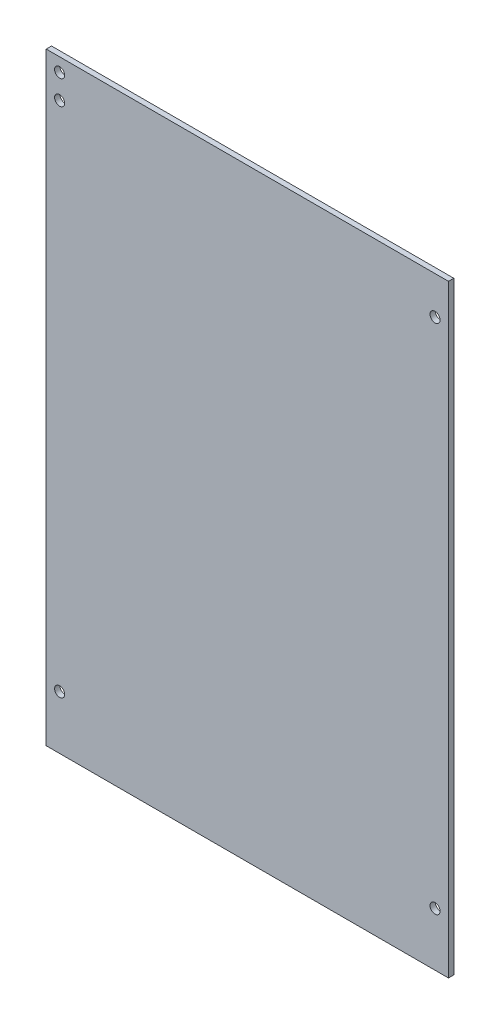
from build123d import *

# Parameters (mm, degrees)
SKETCH1_W          = 120
SKETCH1_H          = 180
EXTRUDE1_DEPTH     = 0.79375
SKETCH2_R          = 1.5
CUT_EXTRUDE1_DEPTH = 109.178187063


with BuildPart() as part:
    # Sketch1 → Extrude1 (new, symmetric)
    with BuildSketch(Plane(origin=(0, 0, 0), x_dir=(-1, 0, 0), z_dir=(0, 0, -1))):
        Rectangle(SKETCH1_W, SKETCH1_H)
    extrude(amount=EXTRUDE1_DEPTH, both=True)

    # Sketch2 → Cut-Extrude1 (cut, through all)
    with BuildSketch(Plane.XY.offset(0.79375)):
        with Locations((-56, -74)):
            Circle(SKETCH2_R)
        with Locations(Location((56, -74, 0), (0, 0, 180))):
            Circle(SKETCH2_R)
        with Locations((56, 78.74)):
            Circle(SKETCH2_R)
        with Locations(Location((-56, 78.74, 0), (0, 0, 180))):
            Circle(SKETCH2_R)
        with Locations((-56, 85.98)):
            Circle(SKETCH2_R)
    extrude(amount=-CUT_EXTRUDE1_DEPTH, mode=Mode.SUBTRACT)


solid = part.part
